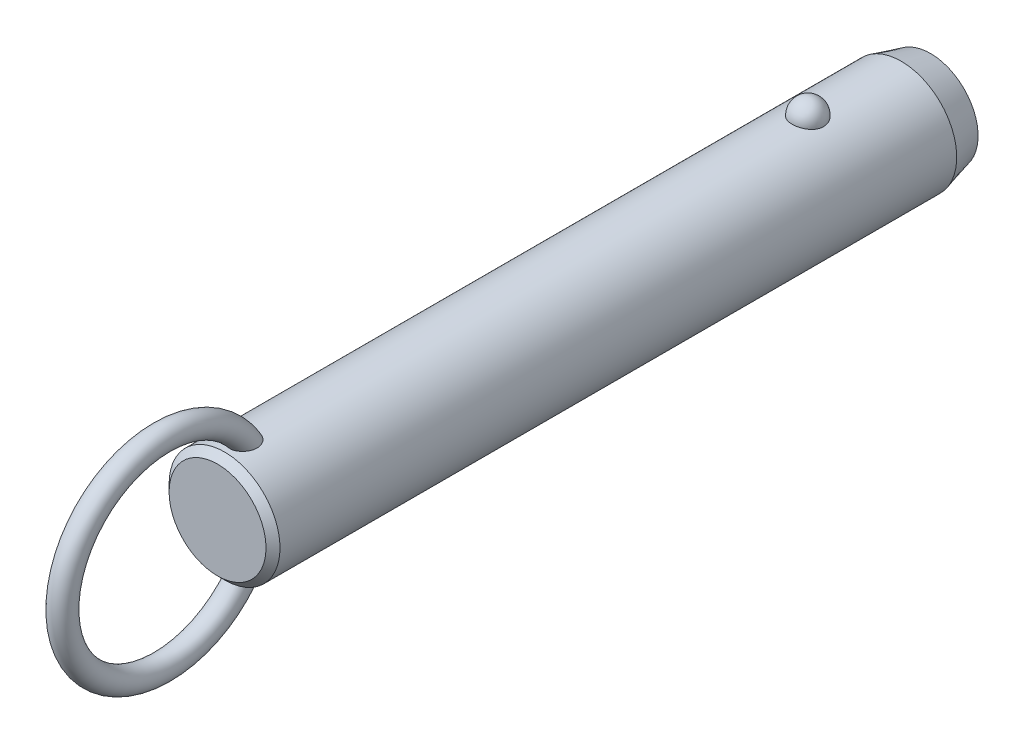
ISO-10303-21;
HEADER;
FILE_DESCRIPTION(('STEP AP214'),'2;1');
FILE_NAME('part.step','',(''),(''),'','','');
FILE_SCHEMA(('AUTOMOTIVE_DESIGN { 1 0 10303 214 1 1 1 1 }'));
ENDSEC;
DATA;
#1=APPLICATION_CONTEXT('core data for automotive mechanical design processes');
#2=APPLICATION_PROTOCOL_DEFINITION('international standard','automotive_design',2000,#1);
#3=PRODUCT_CONTEXT('',#1,'mechanical');
#4=PRODUCT('Part','Part','',(#3));
#5=PRODUCT_RELATED_PRODUCT_CATEGORY('part','',(#4));
#6=PRODUCT_DEFINITION_FORMATION('','',#4);
#7=PRODUCT_DEFINITION_CONTEXT('part definition',#1,'design');
#8=PRODUCT_DEFINITION('design','',#6,#7);
#9=PRODUCT_DEFINITION_SHAPE('','',#8);
#10=(LENGTH_UNIT() NAMED_UNIT(*) SI_UNIT(.MILLI.,.METRE.));
#11=(NAMED_UNIT(*) PLANE_ANGLE_UNIT() SI_UNIT($,.RADIAN.));
#12=(NAMED_UNIT(*) SI_UNIT($,.STERADIAN.) SOLID_ANGLE_UNIT());
#13=UNCERTAINTY_MEASURE_WITH_UNIT(LENGTH_MEASURE(1.E-05),#10,'distance_accuracy_value','');
#14=(GEOMETRIC_REPRESENTATION_CONTEXT(3) GLOBAL_UNCERTAINTY_ASSIGNED_CONTEXT((#13)) GLOBAL_UNIT_ASSIGNED_CONTEXT((#10,
#11,#12)) REPRESENTATION_CONTEXT('',''));
#15=CARTESIAN_POINT('',(0.,0.,0.));
#16=DIRECTION('',(0.,0.,1.));
#17=DIRECTION('',(1.,0.,0.));
#18=AXIS2_PLACEMENT_3D('',#15,#16,#17);
#19=CARTESIAN_POINT('',(0.,0.,88.9));
#20=DIRECTION('',(0.,0.,-1.));
#21=DIRECTION('',(-1.,0.,0.));
#22=AXIS2_PLACEMENT_3D('',#19,#20,#21);
#23=CYLINDRICAL_SURFACE('',#22,9.5);
#24=CARTESIAN_POINT('',(2.67259918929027,9.11631578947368,-2.70000000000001));
#25=CARTESIAN_POINT('',(2.6725968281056,9.11631786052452,-2.54909854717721));
#26=CARTESIAN_POINT('',(2.66030567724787,9.11994722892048,-2.39816735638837));
#27=CARTESIAN_POINT('',(2.6114347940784,9.13405924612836,-2.10058568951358));
#28=CARTESIAN_POINT('',(2.57484658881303,9.14454428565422,-1.95393672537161));
#29=CARTESIAN_POINT('',(2.47830875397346,9.17117631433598,-1.66916069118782));
#30=CARTESIAN_POINT('',(2.41836936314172,9.18732082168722,-1.53102991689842));
#31=CARTESIAN_POINT('',(2.27661331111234,9.22346780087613,-1.26705393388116));
#32=CARTESIAN_POINT('',(2.19479699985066,9.24347021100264,-1.14120852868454));
#33=CARTESIAN_POINT('',(2.01085282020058,9.28522401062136,-0.904632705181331));
#34=CARTESIAN_POINT('',(1.90862396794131,9.30698376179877,-0.793982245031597));
#35=CARTESIAN_POINT('',(1.6867437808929,9.34973971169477,-0.591607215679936));
#36=CARTESIAN_POINT('',(1.56709244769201,9.37073591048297,-0.499882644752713));
#37=CARTESIAN_POINT('',(1.31393976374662,9.40956370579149,-0.338167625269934));
#38=CARTESIAN_POINT('',(1.18048026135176,9.42740444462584,-0.268113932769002));
#39=CARTESIAN_POINT('',(0.903154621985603,9.45799906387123,-0.151390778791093));
#40=CARTESIAN_POINT('',(0.759289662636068,9.47075351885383,-0.104718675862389));
#41=CARTESIAN_POINT('',(0.468074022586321,9.48956256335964,-0.0367633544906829));
#42=CARTESIAN_POINT('',(0.320836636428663,9.49573643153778,-0.0150275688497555));
#43=CARTESIAN_POINT('',(0.0246714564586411,9.50112183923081,0.00396199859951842));
#44=CARTESIAN_POINT('',(-0.124256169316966,9.50033406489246,0.00121819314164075));
#45=CARTESIAN_POINT('',(-0.417264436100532,9.4919475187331,-0.0284441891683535));
#46=CARTESIAN_POINT('',(-0.56138413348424,9.48444885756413,-0.0550074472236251));
#47=CARTESIAN_POINT('',(-0.842986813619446,9.46357853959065,-0.131064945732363));
#48=CARTESIAN_POINT('',(-0.980469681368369,9.450206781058,-0.180559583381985));
#49=CARTESIAN_POINT('',(-1.24585005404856,9.41890822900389,-0.301476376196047));
#50=CARTESIAN_POINT('',(-1.37368611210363,9.40095498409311,-0.373026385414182));
#51=CARTESIAN_POINT('',(-1.61552738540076,9.36242964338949,-0.536025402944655));
#52=CARTESIAN_POINT('',(-1.72953116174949,9.34185727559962,-0.627476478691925));
#53=CARTESIAN_POINT('',(-1.9429225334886,9.29984568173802,-0.829844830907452));
#54=CARTESIAN_POINT('',(-2.04198021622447,9.27839736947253,-0.94110821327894));
#55=CARTESIAN_POINT('',(-2.22026460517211,9.23735994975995,-1.17883414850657));
#56=CARTESIAN_POINT('',(-2.29948985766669,9.21777097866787,-1.30529781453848));
#57=CARTESIAN_POINT('',(-2.43697287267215,9.18238994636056,-1.57158566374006));
#58=CARTESIAN_POINT('',(-2.49497068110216,9.16664569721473,-1.71155057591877));
#59=CARTESIAN_POINT('',(-2.5872073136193,9.14104303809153,-1.99961197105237));
#60=CARTESIAN_POINT('',(-2.62144683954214,9.13118445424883,-2.14770821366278));
#61=CARTESIAN_POINT('',(-2.66521466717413,9.11850622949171,-2.44715424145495));
#62=CARTESIAN_POINT('',(-2.67484831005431,9.11565658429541,-2.59848735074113));
#63=CARTESIAN_POINT('',(-2.66946735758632,9.11723375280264,-2.90067317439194));
#64=CARTESIAN_POINT('',(-2.65445345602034,9.12166036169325,-3.05152590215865));
#65=CARTESIAN_POINT('',(-2.60029711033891,9.13724422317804,-3.34766110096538));
#66=CARTESIAN_POINT('',(-2.56127978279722,9.14836656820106,-3.49296833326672));
#67=CARTESIAN_POINT('',(-2.46018844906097,9.17606676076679,-3.77477535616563));
#68=CARTESIAN_POINT('',(-2.39811349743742,9.1926448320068,-3.9112747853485));
#69=CARTESIAN_POINT('',(-2.25202303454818,9.22952198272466,-4.17244273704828));
#70=CARTESIAN_POINT('',(-2.16788714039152,9.24984129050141,-4.29704106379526));
#71=CARTESIAN_POINT('',(-1.9799408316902,9.29188255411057,-4.53013066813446));
#72=CARTESIAN_POINT('',(-1.87612963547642,9.31360456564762,-4.63862130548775));
#73=CARTESIAN_POINT('',(-1.65105429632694,9.35612959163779,-4.8369029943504));
#74=CARTESIAN_POINT('',(-1.52972405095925,9.37692871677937,-4.92661991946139));
#75=CARTESIAN_POINT('',(-1.27318250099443,9.41518970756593,-5.08429106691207));
#76=CARTESIAN_POINT('',(-1.13797219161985,9.432651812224,-5.15224684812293));
#77=CARTESIAN_POINT('',(-0.859280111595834,9.46208255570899,-5.26371827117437));
#78=CARTESIAN_POINT('',(-0.715925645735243,9.47411833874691,-5.30753421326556));
#79=CARTESIAN_POINT('',(-0.423550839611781,9.4916822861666,-5.37076321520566));
#80=CARTESIAN_POINT('',(-0.2745312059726,9.49721125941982,-5.39017930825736));
#81=CARTESIAN_POINT('',(0.0218446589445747,9.50110860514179,-5.40390587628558));
#82=CARTESIAN_POINT('',(0.16917707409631,9.49961381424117,-5.39869609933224));
#83=CARTESIAN_POINT('',(0.460808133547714,9.48993906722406,-5.36441955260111));
#84=CARTESIAN_POINT('',(0.605106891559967,9.48175936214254,-5.33535367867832));
#85=CARTESIAN_POINT('',(0.886027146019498,9.4596376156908,-5.25435587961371));
#86=CARTESIAN_POINT('',(1.02267710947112,9.44571881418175,-5.20251612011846));
#87=CARTESIAN_POINT('',(1.28523827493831,9.41358993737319,-5.07741549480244));
#88=CARTESIAN_POINT('',(1.41114877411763,9.39537958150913,-5.00415322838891));
#89=CARTESIAN_POINT('',(1.65085227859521,9.3562644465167,-4.83684599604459));
#90=CARTESIAN_POINT('',(1.76442346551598,9.33532178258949,-4.74249218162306));
#91=CARTESIAN_POINT('',(1.97425672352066,9.29321198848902,-4.53620389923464));
#92=CARTESIAN_POINT('',(2.07051582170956,9.27204482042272,-4.42426641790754));
#93=CARTESIAN_POINT('',(2.24490086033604,9.23139221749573,-4.18363183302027));
#94=CARTESIAN_POINT('',(2.32267019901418,9.21194380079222,-4.05466990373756));
#95=CARTESIAN_POINT('',(2.45584092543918,9.1773419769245,-3.78517836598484));
#96=CARTESIAN_POINT('',(2.5112497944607,9.16218713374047,-3.64465264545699));
#97=CARTESIAN_POINT('',(2.59380876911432,9.13913522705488,-3.37104301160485));
#98=CARTESIAN_POINT('',(2.62330266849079,9.13064624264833,-3.23871053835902));
#99=CARTESIAN_POINT('',(2.66269870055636,9.11923566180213,-2.97092664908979));
#100=CARTESIAN_POINT('',(2.67260130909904,9.11631393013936,-2.83547530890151));
#101=CARTESIAN_POINT('',(2.67259918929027,9.11631578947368,-2.70000000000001));
#102=B_SPLINE_CURVE_WITH_KNOTS('',3,(#24,#25,#26,#27,#28,#29,#30,#31,#32,#33,#34,#35,#36,#37,
#38,#39,#40,#41,#42,#43,#44,#45,#46,#47,#48,#49,#50,#51,#52,#53,#54,#55,#56,#57,#58,#59,#60,#61,
#62,#63,#64,#65,#66,#67,#68,#69,#70,#71,#72,#73,#74,#75,#76,#77,#78,#79,#80,#81,#82,#83,#84,#85,
#86,#87,#88,#89,#90,#91,#92,#93,#94,#95,#96,#97,#98,#99,#100,#101),.UNSPECIFIED.,.T.,.F.,(4,2,2,
2,2,2,2,2,2,2,2,2,2,2,2,2,2,2,2,2,2,2,2,2,2,2,2,2,2,2,2,2,2,2,2,2,2,2,4),(0.,0.452217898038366,
0.904593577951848,1.35677112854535,1.80894144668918,2.26340676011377,2.71787203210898,
3.17099820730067,3.62407318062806,4.0687883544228,4.51345969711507,4.95160616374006,
5.38976021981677,5.83050358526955,6.27129275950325,6.72071308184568,7.17016633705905,
7.62495278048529,8.07972578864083,8.53254856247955,8.98535859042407,9.43582813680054,
9.88631615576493,10.3393155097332,10.7923328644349,11.2471065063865,11.7018475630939,
12.150795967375,12.599688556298,13.0398725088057,13.4800399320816,13.9184421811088,
14.3568730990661,14.802202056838,15.2476074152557,15.7010097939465,16.1542603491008,
16.5602594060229,16.966248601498),.UNSPECIFIED.);
#103=CARTESIAN_POINT('',(2.67259918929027,9.11631578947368,-2.70000000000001));
#104=VERTEX_POINT('',#103);
#105=EDGE_CURVE('E41',#104,#104,#102,.T.);
#106=ORIENTED_EDGE('',*,*,#105,.T.);
#107=EDGE_LOOP('',(#106));
#108=FACE_BOUND('',#107,.T.);
#109=CARTESIAN_POINT('',(0.,0.,97.22));
#110=DIRECTION('',(0.,0.,1.));
#111=DIRECTION('',(1.,0.,0.));
#112=AXIS2_PLACEMENT_3D('',#109,#110,#111);
#113=CIRCLE('',#112,9.5);
#114=CARTESIAN_POINT('',(-9.50000000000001,0.,97.22));
#115=VERTEX_POINT('',#114);
#116=EDGE_CURVE('E10',#115,#115,#113,.F.);
#117=ORIENTED_EDGE('',*,*,#116,.T.);
#118=EDGE_LOOP('',(#117));
#119=FACE_BOUND('',#118,.T.);
#120=CARTESIAN_POINT('',(-0.697062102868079,-9.47439269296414,91.5678088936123));
#121=CARTESIAN_POINT('',(-0.799579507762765,-9.46685146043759,91.6074823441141));
#122=CARTESIAN_POINT('',(-0.898575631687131,-9.45788043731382,91.6559309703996));
#123=CARTESIAN_POINT('',(-1.08670047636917,-9.43811593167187,91.7688685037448));
#124=CARTESIAN_POINT('',(-1.17583204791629,-9.42732297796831,91.833352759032));
#125=CARTESIAN_POINT('',(-1.34179806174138,-9.40513672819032,91.9762099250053));
#126=CARTESIAN_POINT('',(-1.41865133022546,-9.39374438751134,92.0545611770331));
#127=CARTESIAN_POINT('',(-1.5586004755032,-9.37154196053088,92.2227524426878));
#128=CARTESIAN_POINT('',(-1.62169476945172,-9.3607319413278,92.3125937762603));
#129=CARTESIAN_POINT('',(-1.73527695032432,-9.34035749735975,92.5045001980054));
#130=CARTESIAN_POINT('',(-1.7852226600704,-9.33085270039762,92.6068910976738));
#131=CARTESIAN_POINT('',(-1.86924997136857,-9.3143834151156,92.818148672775));
#132=CARTESIAN_POINT('',(-1.90332570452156,-9.30741986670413,92.9270177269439));
#133=CARTESIAN_POINT('',(-1.95893603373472,-9.29588482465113,93.1604730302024));
#134=CARTESIAN_POINT('',(-1.97872420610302,-9.29165182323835,93.2854890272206));
#135=CARTESIAN_POINT('',(-2.00062129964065,-9.28695978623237,93.5370805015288));
#136=CARTESIAN_POINT('',(-2.00272284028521,-9.28650232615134,93.663656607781));
#137=CARTESIAN_POINT('',(-1.98958876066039,-9.28932750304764,93.9368157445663));
#138=CARTESIAN_POINT('',(-1.97143366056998,-9.2932400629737,94.0832519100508));
#139=CARTESIAN_POINT('',(-1.91479925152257,-9.30507151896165,94.3720629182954));
#140=CARTESIAN_POINT('',(-1.87629122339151,-9.31299607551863,94.514431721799));
#141=CARTESIAN_POINT('',(-1.77225683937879,-9.33340232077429,94.8151725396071));
#142=CARTESIAN_POINT('',(-1.70334898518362,-9.34641636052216,94.9723691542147));
#143=CARTESIAN_POINT('',(-1.58111062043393,-9.36759153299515,95.1975171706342));
#144=CARTESIAN_POINT('',(-1.53721459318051,-9.37492619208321,95.2707968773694));
#145=CARTESIAN_POINT('',(-1.44302631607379,-9.38988566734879,95.4130740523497));
#146=CARTESIAN_POINT('',(-1.39273721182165,-9.39751033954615,95.4820736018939));
#147=CARTESIAN_POINT('',(-1.26775962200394,-9.41530678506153,95.6369832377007));
#148=CARTESIAN_POINT('',(-1.19052326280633,-9.42548108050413,95.7208712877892));
#149=CARTESIAN_POINT('',(-1.02420241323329,-9.44499825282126,95.8760086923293));
#150=CARTESIAN_POINT('',(-0.935139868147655,-9.45434261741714,95.9472808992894));
#151=CARTESIAN_POINT('',(-0.766610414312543,-9.46930670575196,96.0586955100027));
#152=CARTESIAN_POINT('',(-0.689439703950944,-9.47529223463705,96.1022354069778));
#153=CARTESIAN_POINT('',(-0.528942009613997,-9.48560294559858,96.1763133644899));
#154=CARTESIAN_POINT('',(-0.445620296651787,-9.48992953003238,96.2068624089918));
#155=CARTESIAN_POINT('',(-0.273901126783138,-9.49644161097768,96.2525792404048));
#156=CARTESIAN_POINT('',(-0.185465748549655,-9.49860811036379,96.26761059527));
#157=CARTESIAN_POINT('',(-0.00734541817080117,-9.5004135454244,96.2801494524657));
#158=CARTESIAN_POINT('',(0.0823387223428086,-9.50005405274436,96.2776678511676));
#159=CARTESIAN_POINT('',(0.247679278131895,-9.49708301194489,96.2569959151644));
#160=CARTESIAN_POINT('',(0.323620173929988,-9.49477609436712,96.2409300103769));
#161=CARTESIAN_POINT('',(0.471981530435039,-9.48855917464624,96.1971726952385));
#162=CARTESIAN_POINT('',(0.544400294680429,-9.48464840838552,96.169475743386));
#163=CARTESIAN_POINT('',(0.70894789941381,-9.47398336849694,96.0928026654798));
#164=CARTESIAN_POINT('',(0.799149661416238,-9.46671310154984,96.0397745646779));
#165=CARTESIAN_POINT('',(0.969783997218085,-9.45076225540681,95.9199731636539));
#166=CARTESIAN_POINT('',(1.05019415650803,-9.44207854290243,95.8531692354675));
#167=CARTESIAN_POINT('',(1.23092343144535,-9.42051459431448,95.6807596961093));
#168=CARTESIAN_POINT('',(1.3265249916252,-9.40733378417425,95.5702619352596));
#169=CARTESIAN_POINT('',(1.49893121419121,-9.38140745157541,95.3355614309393));
#170=CARTESIAN_POINT('',(1.57571616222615,-9.36866239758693,95.2113445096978));
#171=CARTESIAN_POINT('',(1.71285426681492,-9.34457644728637,94.9493891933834));
#172=CARTESIAN_POINT('',(1.77266365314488,-9.33328726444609,94.8113623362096));
#173=CARTESIAN_POINT('',(1.87239208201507,-9.31379209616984,94.5280515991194));
#174=CARTESIAN_POINT('',(1.9123015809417,-9.3055875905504,94.382764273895));
#175=CARTESIAN_POINT('',(1.97604189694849,-9.29228394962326,94.0620281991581));
#176=CARTESIAN_POINT('',(1.99587438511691,-9.28797202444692,93.8857248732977));
#177=CARTESIAN_POINT('',(2.0029570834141,-9.28645519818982,93.5324146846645));
#178=CARTESIAN_POINT('',(1.99025930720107,-9.28923895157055,93.3554093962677));
#179=CARTESIAN_POINT('',(1.93735479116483,-9.30038134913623,93.0563381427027));
#180=CARTESIAN_POINT('',(1.90576827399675,-9.30697680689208,92.9326679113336));
#181=CARTESIAN_POINT('',(1.82287484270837,-9.32356855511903,92.692329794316));
#182=CARTESIAN_POINT('',(1.77158213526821,-9.33356239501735,92.5756569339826));
#183=CARTESIAN_POINT('',(1.64885744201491,-9.35602275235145,92.3527061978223));
#184=CARTESIAN_POINT('',(1.57730995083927,-9.36850332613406,92.2464927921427));
#185=CARTESIAN_POINT('',(1.4154326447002,-9.39431873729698,92.0495530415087));
#186=CARTESIAN_POINT('',(1.32510883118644,-9.40765330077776,91.9588217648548));
#187=CARTESIAN_POINT('',(1.13846223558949,-9.43195720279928,91.8050334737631));
#188=CARTESIAN_POINT('',(1.04369890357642,-9.44302894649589,91.7400947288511));
#189=CARTESIAN_POINT('',(0.843965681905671,-9.46296805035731,91.6280388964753));
#190=CARTESIAN_POINT('',(0.739000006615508,-9.47183631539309,91.5809144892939));
#191=CARTESIAN_POINT('',(0.528175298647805,-9.48586140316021,91.5081173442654));
#192=CARTESIAN_POINT('',(0.422686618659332,-9.49119633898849,91.4814024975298));
#193=CARTESIAN_POINT('',(0.208590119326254,-9.49831365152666,91.4460137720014));
#194=CARTESIAN_POINT('',(0.0999817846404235,-9.500095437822,91.4373428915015));
#195=CARTESIAN_POINT('',(-0.126104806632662,-9.49988861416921,91.4383501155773));
#196=CARTESIAN_POINT('',(-0.24357872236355,-9.49757821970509,91.4495942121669));
#197=CARTESIAN_POINT('',(-0.474390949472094,-9.48885165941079,91.493167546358));
#198=CARTESIAN_POINT('',(-0.587729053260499,-9.48243528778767,91.5254978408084));
#199=CARTESIAN_POINT('',(-0.697062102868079,-9.47439269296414,91.5678088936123));
#200=B_SPLINE_CURVE_WITH_KNOTS('',3,(#120,#121,#122,#123,#124,#125,#126,#127,#128,#129,#130,
#131,#132,#133,#134,#135,#136,#137,#138,#139,#140,#141,#142,#143,#144,#145,#146,#147,#148,#149,
#150,#151,#152,#153,#154,#155,#156,#157,#158,#159,#160,#161,#162,#163,#164,#165,#166,#167,#168,
#169,#170,#171,#172,#173,#174,#175,#176,#177,#178,#179,#180,#181,#182,#183,#184,#185,#186,#187,
#188,#189,#190,#191,#192,#193,#194,#195,#196,#197,#198,#199),.UNSPECIFIED.,.T.,.F.,(4,2,2,2,2,2,
2,2,2,2,2,2,2,2,2,2,2,2,2,2,2,2,2,2,2,2,2,2,2,2,2,2,2,2,2,2,2,2,2,4),(0.,0.330119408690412,
0.660143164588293,0.989655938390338,1.31920659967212,1.66074728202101,2.00241415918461,
2.38088696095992,2.7595176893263,3.20065679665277,3.6424200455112,4.15620996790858,
4.4131416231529,4.66994734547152,5.01228664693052,5.35399933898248,5.61943037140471,
5.88463652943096,6.15215502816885,6.41950709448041,6.65144391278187,6.88349136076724,
7.19641200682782,7.51003602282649,7.94779711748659,8.38601491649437,8.83699707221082,
9.28819530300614,9.81778662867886,10.3465317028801,10.7284172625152,11.110028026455,
11.4938603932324,11.8775702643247,12.2220189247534,12.5663259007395,12.8915939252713,
13.2169159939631,13.5689650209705,13.9210316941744),.UNSPECIFIED.);
#201=CARTESIAN_POINT('',(-0.697062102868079,-9.47439269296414,91.5678088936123));
#202=VERTEX_POINT('',#201);
#203=EDGE_CURVE('E60',#202,#202,#200,.T.);
#204=ORIENTED_EDGE('',*,*,#203,.T.);
#205=EDGE_LOOP('',(#204));
#206=FACE_BOUND('',#205,.T.);
#207=CARTESIAN_POINT('',(-0.697062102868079,9.47439269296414,91.5678088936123));
#208=CARTESIAN_POINT('',(-0.597792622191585,9.48169483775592,91.5293956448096));
#209=CARTESIAN_POINT('',(-0.495106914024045,9.48766580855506,91.4991682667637));
#210=CARTESIAN_POINT('',(-0.285876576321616,9.49627648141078,91.4560327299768));
#211=CARTESIAN_POINT('',(-0.179324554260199,9.49890941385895,91.4431597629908));
#212=CARTESIAN_POINT('',(0.0344157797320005,9.50053798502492,91.4351666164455));
#213=CARTESIAN_POINT('',(0.141603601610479,9.49953613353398,91.4400341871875));
#214=CARTESIAN_POINT('',(0.353563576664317,9.49401038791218,91.4673654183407));
#215=CARTESIAN_POINT('',(0.458336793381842,9.48948807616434,91.48982117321));
#216=CARTESIAN_POINT('',(0.66249373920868,9.4774236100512,91.5516719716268));
#217=CARTESIAN_POINT('',(0.761881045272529,9.46988348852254,91.5910556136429));
#218=CARTESIAN_POINT('',(0.952608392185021,9.45260382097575,91.6856342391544));
#219=CARTESIAN_POINT('',(1.04394806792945,9.44286417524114,91.7408299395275));
#220=CARTESIAN_POINT('',(1.21712767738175,9.42211760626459,91.8660662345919));
#221=CARTESIAN_POINT('',(1.29885671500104,9.41109835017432,91.9362579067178));
#222=CARTESIAN_POINT('',(1.44978975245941,9.38903310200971,92.0889801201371));
#223=CARTESIAN_POINT('',(1.51899278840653,9.37798710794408,92.1715116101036));
#224=CARTESIAN_POINT('',(1.64602857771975,9.35654375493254,92.3497763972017));
#225=CARTESIAN_POINT('',(1.70333052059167,9.34618688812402,92.445891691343));
#226=CARTESIAN_POINT('',(1.80259341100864,9.32755128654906,92.645897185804));
#227=CARTESIAN_POINT('',(1.84454942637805,9.31927322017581,92.7497898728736));
#228=CARTESIAN_POINT('',(1.91637039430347,9.30478365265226,92.972213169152));
#229=CARTESIAN_POINT('',(1.944805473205,9.29882552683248,93.0912192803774));
#230=CARTESIAN_POINT('',(1.98449865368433,9.29043398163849,93.3321436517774));
#231=CARTESIAN_POINT('',(1.99574908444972,9.28800213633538,93.4540631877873));
#232=CARTESIAN_POINT('',(2.00275141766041,9.28649645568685,93.7169324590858));
#233=CARTESIAN_POINT('',(1.99588238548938,9.28799035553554,93.8579529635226));
#234=CARTESIAN_POINT('',(1.96270559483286,9.29505517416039,94.1376217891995));
#235=CARTESIAN_POINT('',(1.93637872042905,9.30063010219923,94.276267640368));
#236=CARTESIAN_POINT('',(1.85949176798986,9.31633564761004,94.5725616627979));
#237=CARTESIAN_POINT('',(1.80549792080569,9.3270926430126,94.7292907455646));
#238=CARTESIAN_POINT('',(1.67376869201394,9.3516306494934,95.0322840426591));
#239=CARTESIAN_POINT('',(1.59603181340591,9.36541185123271,95.1785475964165));
#240=CARTESIAN_POINT('',(1.4360277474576,9.39110706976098,95.4258138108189));
#241=CARTESIAN_POINT('',(1.35831795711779,9.40278656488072,95.529791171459));
#242=CARTESIAN_POINT('',(1.18774483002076,9.42585025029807,95.7245347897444));
#243=CARTESIAN_POINT('',(1.09490932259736,9.43723493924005,95.8153247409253));
#244=CARTESIAN_POINT('',(0.921110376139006,9.45552616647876,95.9562033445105));
#245=CARTESIAN_POINT('',(0.843738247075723,9.46281058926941,96.0106563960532));
#246=CARTESIAN_POINT('',(0.681245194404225,9.47589120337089,96.1067117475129));
#247=CARTESIAN_POINT('',(0.596135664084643,9.48168953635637,96.1483325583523));
#248=CARTESIAN_POINT('',(0.433779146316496,9.49038144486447,96.2100899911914));
#249=CARTESIAN_POINT('',(0.357459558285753,9.49359170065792,96.2326013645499));
#250=CARTESIAN_POINT('',(0.202074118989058,9.49816761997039,96.2645745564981));
#251=CARTESIAN_POINT('',(0.123010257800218,9.49953459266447,96.2740456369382));
#252=CARTESIAN_POINT('',(-0.0357372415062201,9.50026497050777,96.2791143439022));
#253=CARTESIAN_POINT('',(-0.115421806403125,9.49962433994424,96.2746840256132));
#254=CARTESIAN_POINT('',(-0.272823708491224,9.49640854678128,96.2522962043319));
#255=CARTESIAN_POINT('',(-0.350540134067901,9.4938325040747,96.2343325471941));
#256=CARTESIAN_POINT('',(-0.500580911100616,9.4870946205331,96.1868028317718));
#257=CARTESIAN_POINT('',(-0.57297929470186,9.48296359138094,96.1574618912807));
#258=CARTESIAN_POINT('',(-0.712864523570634,9.47347609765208,96.0890087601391));
#259=CARTESIAN_POINT('',(-0.780349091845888,9.46811906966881,96.0498920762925));
#260=CARTESIAN_POINT('',(-0.946309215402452,9.45329720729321,95.9394327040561));
#261=CARTESIAN_POINT('',(-1.04090230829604,9.44321512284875,95.8623297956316));
#262=CARTESIAN_POINT('',(-1.21661929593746,9.42219227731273,95.6940971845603));
#263=CARTESIAN_POINT('',(-1.29770519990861,9.41124921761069,95.6029292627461));
#264=CARTESIAN_POINT('',(-1.47319646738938,9.38563439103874,95.3761621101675));
#265=CARTESIAN_POINT('',(-1.56208878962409,9.37102009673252,95.2362895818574));
#266=CARTESIAN_POINT('',(-1.71623987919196,9.34401559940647,94.9439503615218));
#267=CARTESIAN_POINT('',(-1.78147866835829,9.33162728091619,94.791473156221));
#268=CARTESIAN_POINT('',(-1.88853837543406,9.31055541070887,94.4756470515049));
#269=CARTESIAN_POINT('',(-1.92998995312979,9.30193076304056,94.3121685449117));
#270=CARTESIAN_POINT('',(-1.98590726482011,9.29015757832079,93.9805268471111));
#271=CARTESIAN_POINT('',(-2.0004070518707,9.2870021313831,93.8123698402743));
#272=CARTESIAN_POINT('',(-1.99964701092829,9.28716218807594,93.5050806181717));
#273=CARTESIAN_POINT('',(-1.98908145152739,9.28945704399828,93.3659362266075));
#274=CARTESIAN_POINT('',(-1.94566294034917,9.29865169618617,93.0911539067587));
#275=CARTESIAN_POINT('',(-1.91282062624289,9.30554929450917,92.955514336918));
#276=CARTESIAN_POINT('',(-1.84582133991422,9.31898248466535,92.7578026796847));
#277=CARTESIAN_POINT('',(-1.82038084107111,9.32400364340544,92.692583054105));
#278=CARTESIAN_POINT('',(-1.7635051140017,9.33492884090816,92.5649033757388));
#279=CARTESIAN_POINT('',(-1.73207305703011,9.34083241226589,92.5024418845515));
#280=CARTESIAN_POINT('',(-1.6632424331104,9.353333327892,92.3809407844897));
#281=CARTESIAN_POINT('',(-1.62584239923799,9.35993084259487,92.3219020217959));
#282=CARTESIAN_POINT('',(-1.54527678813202,9.37356864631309,92.2079875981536));
#283=CARTESIAN_POINT('',(-1.50211241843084,9.38060884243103,92.1531110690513));
#284=CARTESIAN_POINT('',(-1.37681147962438,9.40004442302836,92.009961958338));
#285=CARTESIAN_POINT('',(-1.28916358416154,9.41261047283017,91.9264295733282));
#286=CARTESIAN_POINT('',(-1.09996826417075,9.43658180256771,91.7772360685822));
#287=CARTESIAN_POINT('',(-0.998461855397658,9.44799034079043,91.7115238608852));
#288=CARTESIAN_POINT('',(-0.860188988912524,9.46103017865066,91.6394367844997));
#289=CARTESIAN_POINT('',(-0.828141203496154,9.46389141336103,91.6238511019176));
#290=CARTESIAN_POINT('',(-0.763210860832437,9.46934915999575,91.5944734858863));
#291=CARTESIAN_POINT('',(-0.730328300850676,9.47194567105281,91.5806815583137));
#292=CARTESIAN_POINT('',(-0.697062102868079,9.47439269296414,91.5678088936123));
#293=B_SPLINE_CURVE_WITH_KNOTS('',3,(#207,#208,#209,#210,#211,#212,#213,#214,#215,#216,#217,
#218,#219,#220,#221,#222,#223,#224,#225,#226,#227,#228,#229,#230,#231,#232,#233,#234,#235,#236,
#237,#238,#239,#240,#241,#242,#243,#244,#245,#246,#247,#248,#249,#250,#251,#252,#253,#254,#255,
#256,#257,#258,#259,#260,#261,#262,#263,#264,#265,#266,#267,#268,#269,#270,#271,#272,#273,#274,
#275,#276,#277,#278,#279,#280,#281,#282,#283,#284,#285,#286,#287,#288,#289,#290,#291,#292),
.UNSPECIFIED.,.T.,.F.,(4,2,2,2,2,2,2,2,2,2,2,2,2,2,2,2,2,2,2,2,2,2,2,2,2,2,2,2,2,2,2,2,2,2,2,2,
2,2,2,2,2,2,4),(0.,0.319942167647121,0.640532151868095,0.960900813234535,1.28112555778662,
1.60113495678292,1.92115886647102,2.24457323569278,2.56801248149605,2.90371927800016,
3.23953387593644,3.60560313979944,3.97183576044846,4.39383693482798,4.81625324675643,
5.31257045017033,5.80891895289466,6.19868344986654,6.58773876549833,6.87145417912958,
7.15475838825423,7.3926375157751,7.63034760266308,7.86853584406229,8.10683246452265,
8.3406366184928,8.57454843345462,8.93983939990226,9.30614105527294,9.8026666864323,
10.2996107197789,10.8040753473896,11.3079021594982,11.7249776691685,12.1418541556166,
12.3521485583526,12.562331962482,12.7725671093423,12.9827582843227,13.345827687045,
13.7078449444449,13.8150604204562,13.9222762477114),.UNSPECIFIED.);
#294=CARTESIAN_POINT('',(-0.697062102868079,9.47439269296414,91.5678088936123));
#295=VERTEX_POINT('',#294);
#296=EDGE_CURVE('E68',#295,#295,#293,.T.);
#297=ORIENTED_EDGE('',*,*,#296,.T.);
#298=EDGE_LOOP('',(#297));
#299=FACE_BOUND('',#298,.T.);
#300=CARTESIAN_POINT('',(0.,0.,-18.6999999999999));
#301=DIRECTION('',(0.,0.,-1.));
#302=DIRECTION('',(-1.,0.,0.));
#303=AXIS2_PLACEMENT_3D('',#300,#301,#302);
#304=CIRCLE('',#303,9.5);
#305=CARTESIAN_POINT('',(-9.5,0.,-18.6999999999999));
#306=VERTEX_POINT('',#305);
#307=EDGE_CURVE('E57',#306,#306,#304,.F.);
#308=ORIENTED_EDGE('',*,*,#307,.T.);
#309=EDGE_LOOP('',(#308));
#310=FACE_BOUND('',#309,.T.);
#311=ADVANCED_FACE('F37',(#108,#119,#206,#299,#310),#23,.T.);
#312=CARTESIAN_POINT('',(0.,0.,-23.7));
#313=DIRECTION('',(0.,0.,-1.));
#314=DIRECTION('',(-1.,0.,0.));
#315=AXIS2_PLACEMENT_3D('',#312,#313,#314);
#316=PLANE('',#315);
#317=CARTESIAN_POINT('',(0.,0.,-23.7));
#318=DIRECTION('',(0.,0.,-1.));
#319=DIRECTION('',(-1.,0.,0.));
#320=AXIS2_PLACEMENT_3D('',#317,#318,#319);
#321=CIRCLE('',#320,8.16025403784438);
#322=CARTESIAN_POINT('',(-8.16025403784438,0.,-23.7));
#323=VERTEX_POINT('',#322);
#324=EDGE_CURVE('E67',#323,#323,#321,.T.);
#325=ORIENTED_EDGE('',*,*,#324,.T.);
#326=EDGE_LOOP('',(#325));
#327=FACE_BOUND('',#326,.T.);
#328=ADVANCED_FACE('F86',(#327),#316,.T.);
#329=CARTESIAN_POINT('',(0.,0.,-23.7));
#330=DIRECTION('',(0.,0.,1.));
#331=DIRECTION('',(1.,0.,0.));
#332=AXIS2_PLACEMENT_3D('',#329,#330,#331);
#333=CONICAL_SURFACE('',#332,8.16025403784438,0.261799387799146);
#334=ORIENTED_EDGE('',*,*,#307,.F.);
#335=EDGE_LOOP('',(#334));
#336=FACE_BOUND('',#335,.T.);
#337=ORIENTED_EDGE('',*,*,#324,.F.);
#338=EDGE_LOOP('',(#337));
#339=FACE_BOUND('',#338,.T.);
#340=ADVANCED_FACE('F84',(#336,#339),#333,.T.);
#341=CARTESIAN_POINT('',(0.,0.,98.42));
#342=DIRECTION('',(0.,0.,1.));
#343=DIRECTION('',(1.,0.,0.));
#344=AXIS2_PLACEMENT_3D('',#341,#342,#343);
#345=PLANE('',#344);
#346=CARTESIAN_POINT('',(0.,0.,98.42));
#347=DIRECTION('',(0.,0.,1.));
#348=DIRECTION('',(1.,0.,0.));
#349=AXIS2_PLACEMENT_3D('',#346,#347,#348);
#350=CIRCLE('',#349,8.29999999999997);
#351=CARTESIAN_POINT('',(-8.29999999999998,0.,98.42));
#352=VERTEX_POINT('',#351);
#353=EDGE_CURVE('E50',#352,#352,#350,.T.);
#354=ORIENTED_EDGE('',*,*,#353,.T.);
#355=EDGE_LOOP('',(#354));
#356=FACE_BOUND('',#355,.T.);
#357=ADVANCED_FACE('F78',(#356),#345,.T.);
#358=CARTESIAN_POINT('',(0.,0.,107.95));
#359=DIRECTION('',(1.,0.,0.));
#360=DIRECTION('',(0.,0.,-1.));
#361=AXIS2_PLACEMENT_3D('',#358,#359,#360);
#362=TOROIDAL_SURFACE('',#361,17.05,2.);
#363=ORIENTED_EDGE('',*,*,#296,.F.);
#364=EDGE_LOOP('',(#363));
#365=FACE_BOUND('',#364,.T.);
#366=ORIENTED_EDGE('',*,*,#203,.F.);
#367=EDGE_LOOP('',(#366));
#368=FACE_BOUND('',#367,.T.);
#369=ADVANCED_FACE('F74',(#365,#368),#362,.T.);
#370=CARTESIAN_POINT('',(0.,0.,98.42));
#371=DIRECTION('',(0.,0.,-1.));
#372=DIRECTION('',(-1.,0.,0.));
#373=AXIS2_PLACEMENT_3D('',#370,#371,#372);
#374=CONICAL_SURFACE('',#373,8.29999999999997,0.78539816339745);
#375=CARTESIAN_POINT('',(-9.50000000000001,0.,97.22));
#376=CARTESIAN_POINT('',(-9.48750000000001,0.,97.2325));
#377=CARTESIAN_POINT('',(-9.47500000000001,0.,97.245));
#378=CARTESIAN_POINT('',(-9.45,0.,97.27));
#379=CARTESIAN_POINT('',(-9.4375,0.,97.2825));
#380=CARTESIAN_POINT('',(-9.4125,0.,97.3075));
#381=CARTESIAN_POINT('',(-9.4,0.,97.32));
#382=CARTESIAN_POINT('',(-9.37500000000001,0.,97.345));
#383=CARTESIAN_POINT('',(-9.3625,0.,97.3575));
#384=CARTESIAN_POINT('',(-9.3375,0.,97.3825));
#385=CARTESIAN_POINT('',(-9.325,0.,97.395));
#386=CARTESIAN_POINT('',(-9.3,0.,97.42));
#387=CARTESIAN_POINT('',(-9.2875,0.,97.4325));
#388=CARTESIAN_POINT('',(-9.2625,0.,97.4575));
#389=CARTESIAN_POINT('',(-9.25,0.,97.47));
#390=CARTESIAN_POINT('',(-9.225,0.,97.495));
#391=CARTESIAN_POINT('',(-9.2125,0.,97.5075));
#392=CARTESIAN_POINT('',(-9.1875,0.,97.5325));
#393=CARTESIAN_POINT('',(-9.175,0.,97.545));
#394=CARTESIAN_POINT('',(-9.15,0.,97.57));
#395=CARTESIAN_POINT('',(-9.1375,0.,97.5825));
#396=CARTESIAN_POINT('',(-9.1125,0.,97.6075));
#397=CARTESIAN_POINT('',(-9.1,0.,97.62));
#398=CARTESIAN_POINT('',(-9.075,0.,97.645));
#399=CARTESIAN_POINT('',(-9.0625,0.,97.6575));
#400=CARTESIAN_POINT('',(-9.0375,0.,97.6825));
#401=CARTESIAN_POINT('',(-9.025,0.,97.695));
#402=CARTESIAN_POINT('',(-9.,0.,97.72));
#403=CARTESIAN_POINT('',(-8.98749999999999,0.,97.7325));
#404=CARTESIAN_POINT('',(-8.9625,0.,97.7575));
#405=CARTESIAN_POINT('',(-8.94999999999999,0.,97.77));
#406=CARTESIAN_POINT('',(-8.925,0.,97.795));
#407=CARTESIAN_POINT('',(-8.91249999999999,0.,97.8075));
#408=CARTESIAN_POINT('',(-8.88749999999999,0.,97.8325));
#409=CARTESIAN_POINT('',(-8.87499999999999,0.,97.845));
#410=CARTESIAN_POINT('',(-8.84999999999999,0.,97.87));
#411=CARTESIAN_POINT('',(-8.83749999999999,0.,97.8825));
#412=CARTESIAN_POINT('',(-8.81249999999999,0.,97.9075));
#413=CARTESIAN_POINT('',(-8.79999999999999,0.,97.92));
#414=CARTESIAN_POINT('',(-8.77499999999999,0.,97.945));
#415=CARTESIAN_POINT('',(-8.76249999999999,0.,97.9575));
#416=CARTESIAN_POINT('',(-8.73749999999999,0.,97.9825));
#417=CARTESIAN_POINT('',(-8.72499999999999,0.,97.995));
#418=CARTESIAN_POINT('',(-8.69999999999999,0.,98.02));
#419=CARTESIAN_POINT('',(-8.68749999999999,0.,98.0325));
#420=CARTESIAN_POINT('',(-8.66249999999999,0.,98.0575));
#421=CARTESIAN_POINT('',(-8.64999999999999,0.,98.07));
#422=CARTESIAN_POINT('',(-8.62499999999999,0.,98.095));
#423=CARTESIAN_POINT('',(-8.61249999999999,0.,98.1075));
#424=CARTESIAN_POINT('',(-8.58749999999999,0.,98.1325));
#425=CARTESIAN_POINT('',(-8.57499999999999,0.,98.145));
#426=CARTESIAN_POINT('',(-8.54999999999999,0.,98.17));
#427=CARTESIAN_POINT('',(-8.53749999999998,0.,98.1825));
#428=CARTESIAN_POINT('',(-8.51249999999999,0.,98.2075));
#429=CARTESIAN_POINT('',(-8.49999999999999,0.,98.22));
#430=CARTESIAN_POINT('',(-8.47499999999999,0.,98.245));
#431=CARTESIAN_POINT('',(-8.46249999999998,0.,98.2575));
#432=CARTESIAN_POINT('',(-8.43749999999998,0.,98.2825));
#433=CARTESIAN_POINT('',(-8.42499999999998,0.,98.295));
#434=CARTESIAN_POINT('',(-8.39999999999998,0.,98.32));
#435=CARTESIAN_POINT('',(-8.38749999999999,0.,98.3325));
#436=CARTESIAN_POINT('',(-8.36249999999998,0.,98.3575));
#437=CARTESIAN_POINT('',(-8.34999999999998,0.,98.37));
#438=CARTESIAN_POINT('',(-8.32499999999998,0.,98.395));
#439=CARTESIAN_POINT('',(-8.31249999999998,0.,98.4075));
#440=CARTESIAN_POINT('',(-8.29999999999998,0.,98.42));
#441=B_SPLINE_CURVE_WITH_KNOTS('',3,(#375,#376,#377,#378,#379,#380,#381,#382,#383,#384,#385,
#386,#387,#388,#389,#390,#391,#392,#393,#394,#395,#396,#397,#398,#399,#400,#401,#402,#403,#404,
#405,#406,#407,#408,#409,#410,#411,#412,#413,#414,#415,#416,#417,#418,#419,#420,#421,#422,#423,
#424,#425,#426,#427,#428,#429,#430,#431,#432,#433,#434,#435,#436,#437,#438,#439,#440),
.UNSPECIFIED.,.F.,.F.,(4,2,2,2,2,2,2,2,2,2,2,2,2,2,2,2,2,2,2,2,2,2,2,2,2,2,2,2,2,2,2,2,4),(0.,
0.0530330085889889,0.106066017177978,0.159099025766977,0.212132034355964,0.265165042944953,
0.318198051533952,0.371231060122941,0.42426406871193,0.477297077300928,0.530330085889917,
0.583363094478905,0.636396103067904,0.689429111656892,0.742462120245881,0.79549512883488,
0.848528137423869,0.901561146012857,0.954594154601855,1.00762716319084,1.06066017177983,
1.11369318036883,1.16672618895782,1.21975919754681,1.27279220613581,1.3258252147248,
1.37885822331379,1.43189123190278,1.48492424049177,1.53795724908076,1.59099025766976,
1.64402326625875,1.69705627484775),.UNSPECIFIED.);
#442=EDGE_CURVE('BSEAM39',#115,#352,#441,.T.);
#443=ORIENTED_EDGE('',*,*,#116,.F.);
#444=ORIENTED_EDGE('',*,*,#353,.F.);
#445=ORIENTED_EDGE('',*,*,#442,.T.);
#446=ORIENTED_EDGE('',*,*,#442,.F.);
#447=EDGE_LOOP('',(#443,#445,#444,#446));
#448=FACE_BOUND('',#447,.T.);
#449=ADVANCED_FACE('F39',(#448),#374,.T.);
#450=CARTESIAN_POINT('',(0.,9.5,-2.70000000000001));
#451=DIRECTION('',(0.,1.,0.));
#452=DIRECTION('',(0.,0.,-1.));
#453=AXIS2_PLACEMENT_3D('',#450,#451,#452);
#454=SPHERICAL_SURFACE('',#453,2.7);
#455=ORIENTED_EDGE('',*,*,#105,.F.);
#456=EDGE_LOOP('',(#455));
#457=FACE_BOUND('',#456,.T.);
#458=ADVANCED_FACE('F80',(#457),#454,.T.);
#459=CLOSED_SHELL('',(#311,#328,#340,#357,#369,#449,#458));
#460=MANIFOLD_SOLID_BREP('B2',#459);
#461=ADVANCED_BREP_SHAPE_REPRESENTATION('',(#18,#460),#14);
#462=SHAPE_DEFINITION_REPRESENTATION(#9,#461);
ENDSEC;
END-ISO-10303-21;
